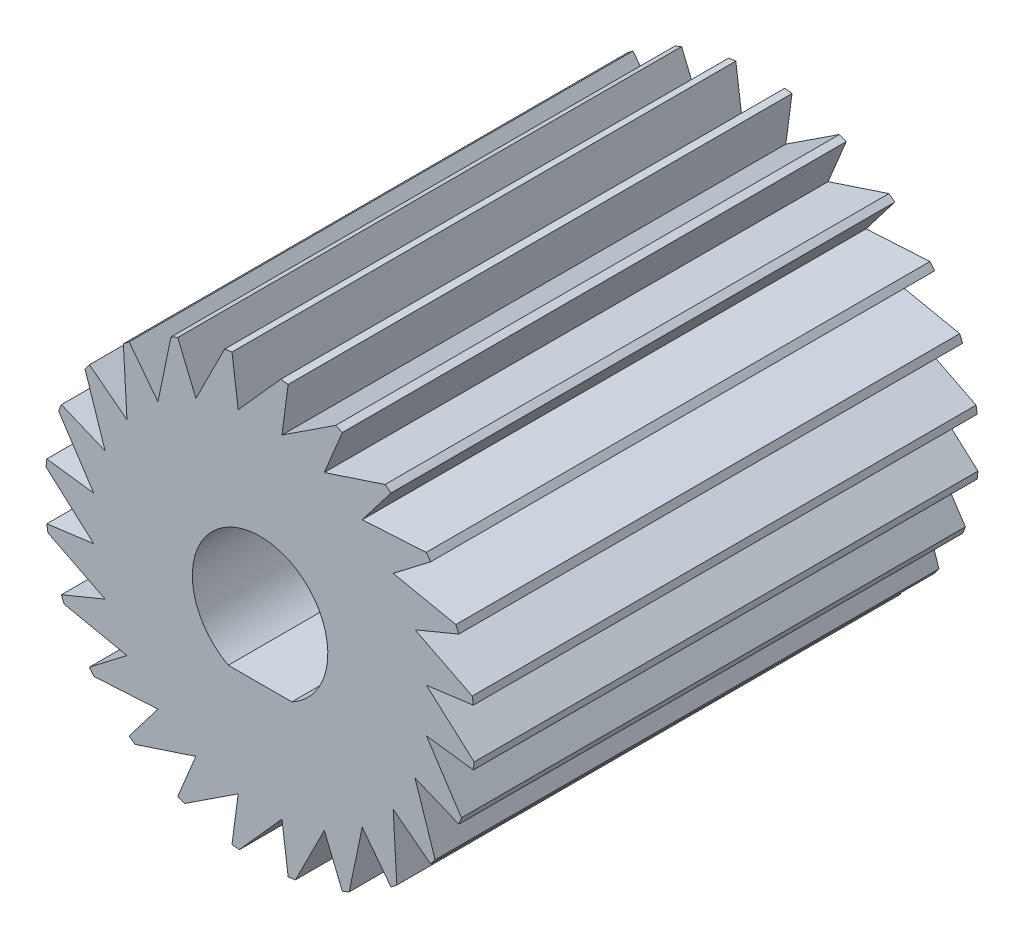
from build123d import *

# Parameters (mm, degrees)
SKETCH1_R               = 9.906
SKETCH1_R_2             = 4.7625
BOSS_EXTRUDE1_DEPTH     = 6.35
BOSS_EXTRUDE2_DEPTH     = 6.35
CIRPATTERN1_COUNT       = 24
CHAMFER1_SIZE           = 0.09525
SKETCH3_R               = 317.5
SKETCH3_R_2             = 12.7
CUT_EXTRUDE_THIN1_DEPTH = 20.746083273
SCALE1_SCALE            = 0.4
SKETCH4_R               = 2.382949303
BOSS_EXTRUDE3_DEPTH     = 2.54
BOSS_EXTRUDE4_DEPTH     = 11.9
CUT_EXTRUDE1_DEPTH      = 14.883231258


with BuildPart() as part:
    # Sketch1 → Boss-Extrude1 (new body)
    with BuildSketch(Plane.XY):
        Circle(SKETCH1_R)
        Circle(SKETCH1_R_2, mode=Mode.SUBTRACT)
    extrude(amount=-BOSS_EXTRUDE1_DEPTH)

    # Sketch2 → Boss-Extrude2 (add)
    with BuildSketch(Plane.XY):
        with BuildLine():
            Line((-1.29299246, 9.821252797), (1.740566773, 13.220917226))
            Line((1.740566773, 13.220917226), (1.29299246, 9.821252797))
            ThreePointArc((1.29299246, 9.821252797), (0, 9.906), (-1.29299246, 9.821252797))
        make_face()
    boss_extrude2 = extrude(amount=-BOSS_EXTRUDE2_DEPTH)

    # CirPattern1: Boss-Extrude2 ×24 about axis
    cirpattern1_axis = Axis((0, 0, 0), (0, 0, 1))
    for i in range(1, CIRPATTERN1_COUNT):
        add(boss_extrude2.rotate(cirpattern1_axis, i * 360 / CIRPATTERN1_COUNT))

    # Chamfer1
    chamfer1_edges = [part.edges().sort_by_distance(p)[0] for p in [
        (-4.7625, 0, -6.35),
        (-4.7625, 0, 0),
    ]]
    chamfer(chamfer1_edges, length=CHAMFER1_SIZE)

    # Sketch3 → Cut-Extrude-Thin1 (cut, through all)
    with BuildSketch(Plane.XY):
        Circle(SKETCH3_R)
        Circle(SKETCH3_R_2, mode=Mode.SUBTRACT)
    extrude(amount=-CUT_EXTRUDE_THIN1_DEPTH, mode=Mode.SUBTRACT)


with BuildPart() as part_1:
    # Scale1: scaled about (0, 0, -3.175)
    add(part.part.scale(SCALE1_SCALE).moved(Location((0, 0, -1.905))))

    # Sketch4 → Boss-Extrude3 (add)
    with BuildSketch(Plane.XY.offset(-1.905)):
        Circle(SKETCH4_R)
    extrude(amount=-BOSS_EXTRUDE3_DEPTH)

    # Sketch6 → Boss-Extrude4 (add)
    with BuildSketch(Plane.XY.offset(-1.905)):
        with BuildLine():
            Line((3.928501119, 0.517196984), (5.036539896, 0.663073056))
            ThreePointArc((5.036539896, 0.663073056), (5.024373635, 0.749712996), (5.010717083, 0.836130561))
            Line((5.010717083, 0.836130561), (3.66078026, 1.516344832))
            Line((3.66078026, 1.516344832), (4.693308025, 1.944031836))
            ThreePointArc((4.693308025, 1.944031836), (4.659132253, 2.024570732), (4.623574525, 2.104509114))
            Line((4.623574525, 2.104509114), (3.143583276, 2.412156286))
            Line((3.143583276, 2.412156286), (4.030234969, 3.092508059))
            ThreePointArc((4.030234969, 3.092508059), (3.976378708, 3.161457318), (3.921343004, 3.229468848))
            Line((3.921343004, 3.229468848), (2.412156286, 3.143583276))
            Line((2.412156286, 3.143583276), (3.092508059, 4.030234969))
            ThreePointArc((3.092508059, 4.030234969), (3.022641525, 4.082895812), (2.951878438, 4.134345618))
            Line((2.951878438, 4.134345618), (1.516344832, 3.66078026))
            Line((1.516344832, 3.66078026), (1.944031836, 4.693308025))
            ThreePointArc((1.944031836, 4.693308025), (1.862916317, 4.726091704), (1.781248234, 4.757473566))
            Line((1.781248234, 4.757473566), (0.517196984, 3.928501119))
            Line((0.517196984, 3.928501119), (0.663073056, 5.036539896))
            ThreePointArc((0.663073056, 5.036539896), (0.576236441, 5.047212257), (0.489228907, 5.056387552))
            Line((0.489228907, 5.056387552), (-0.517196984, 3.928501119))
            Line((-0.517196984, 3.928501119), (-0.663073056, 5.036539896))
            ThreePointArc((-0.663073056, 5.036539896), (-0.749712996, 5.024373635), (-0.836130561, 5.010717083))
            Line((-0.836130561, 5.010717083), (-1.516344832, 3.66078026))
            Line((-1.516344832, 3.66078026), (-1.944031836, 4.693308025))
            ThreePointArc((-1.944031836, 4.693308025), (-2.024570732, 4.659132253), (-2.104509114, 4.623574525))
            Line((-2.104509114, 4.623574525), (-2.412156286, 3.143583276))
            Line((-2.412156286, 3.143583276), (-3.092508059, 4.030234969))
            ThreePointArc((-3.092508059, 4.030234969), (-3.161457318, 3.976378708), (-3.229468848, 3.921343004))
            Line((-3.229468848, 3.921343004), (-3.143583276, 2.412156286))
            Line((-3.143583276, 2.412156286), (-4.030234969, 3.092508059))
            ThreePointArc((-4.030234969, 3.092508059), (-4.082895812, 3.022641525), (-4.134345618, 2.951878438))
            Line((-4.134345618, 2.951878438), (-3.66078026, 1.516344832))
            Line((-3.66078026, 1.516344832), (-4.693308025, 1.944031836))
            ThreePointArc((-4.693308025, 1.944031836), (-4.726091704, 1.862916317), (-4.757473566, 1.781248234))
            Line((-4.757473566, 1.781248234), (-3.928501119, 0.517196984))
            Line((-3.928501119, 0.517196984), (-5.036539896, 0.663073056))
            ThreePointArc((-5.036539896, 0.663073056), (-5.047212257, 0.576236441), (-5.056387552, 0.489228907))
            Line((-5.056387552, 0.489228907), (-3.928501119, -0.517196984))
            Line((-3.928501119, -0.517196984), (-5.036539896, -0.663073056))
            ThreePointArc((-5.036539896, -0.663073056), (-5.024373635, -0.749712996), (-5.010717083, -0.836130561))
            Line((-5.010717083, -0.836130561), (-3.66078026, -1.516344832))
            Line((-3.66078026, -1.516344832), (-4.693308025, -1.944031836))
            ThreePointArc((-4.693308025, -1.944031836), (-4.659132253, -2.024570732), (-4.623574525, -2.104509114))
            Line((-4.623574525, -2.104509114), (-3.143583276, -2.412156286))
            Line((-3.143583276, -2.412156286), (-4.030234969, -3.092508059))
            ThreePointArc((-4.030234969, -3.092508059), (-3.976378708, -3.161457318), (-3.921343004, -3.229468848))
            Line((-3.921343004, -3.229468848), (-2.412156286, -3.143583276))
            Line((-2.412156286, -3.143583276), (-3.092508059, -4.030234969))
            ThreePointArc((-3.092508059, -4.030234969), (-3.022641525, -4.082895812), (-2.951878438, -4.134345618))
            Line((-2.951878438, -4.134345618), (-1.516344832, -3.66078026))
            Line((-1.516344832, -3.66078026), (-1.944031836, -4.693308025))
            ThreePointArc((-1.944031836, -4.693308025), (-1.862916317, -4.726091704), (-1.781248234, -4.757473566))
            Line((-1.781248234, -4.757473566), (-0.517196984, -3.928501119))
            Line((-0.517196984, -3.928501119), (-0.663073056, -5.036539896))
            ThreePointArc((-0.663073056, -5.036539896), (-0.576236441, -5.047212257), (-0.489228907, -5.056387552))
            Line((-0.489228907, -5.056387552), (0.517196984, -3.928501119))
            Line((0.517196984, -3.928501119), (0.663073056, -5.036539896))
            ThreePointArc((0.663073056, -5.036539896), (0.749712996, -5.024373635), (0.836130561, -5.010717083))
            Line((0.836130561, -5.010717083), (1.516344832, -3.66078026))
            Line((1.516344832, -3.66078026), (1.944031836, -4.693308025))
            ThreePointArc((1.944031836, -4.693308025), (2.024570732, -4.659132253), (2.104509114, -4.623574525))
            Line((2.104509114, -4.623574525), (2.412156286, -3.143583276))
            Line((2.412156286, -3.143583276), (3.092508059, -4.030234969))
            ThreePointArc((3.092508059, -4.030234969), (3.161457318, -3.976378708), (3.229468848, -3.921343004))
            Line((3.229468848, -3.921343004), (3.143583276, -2.412156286))
            Line((3.143583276, -2.412156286), (4.030234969, -3.092508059))
            ThreePointArc((4.030234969, -3.092508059), (4.082895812, -3.022641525), (4.134345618, -2.951878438))
            Line((4.134345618, -2.951878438), (3.66078026, -1.516344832))
            Line((3.66078026, -1.516344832), (4.693308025, -1.944031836))
            ThreePointArc((4.693308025, -1.944031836), (4.726091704, -1.862916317), (4.757473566, -1.781248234))
            Line((4.757473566, -1.781248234), (3.928501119, -0.517196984))
            Line((3.928501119, -0.517196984), (5.036539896, -0.663073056))
            ThreePointArc((5.036539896, -0.663073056), (5.047212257, -0.576236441), (5.056387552, -0.489228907))
            Line((5.056387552, -0.489228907), (3.928501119, 0.517196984))
        make_face()
    extrude(amount=-BOSS_EXTRUDE4_DEPTH)

    # Sketch5 → Cut-Extrude1 (cut, through all)
    with BuildSketch(Plane.XY.offset(-1.905)):
        with BuildLine():
            Line((-0.75, -1.413329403), (0.75, -1.413329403))
            ThreePointArc((0.75, -1.413329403), (1.37113092, -0.824621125), (1.6, 0))
            ThreePointArc((1.6, 0), (-0.824621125, 1.37113092), (-0.75, -1.413329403))
        make_face()
    extrude(amount=-CUT_EXTRUDE1_DEPTH, mode=Mode.SUBTRACT)


solid = part_1.part
